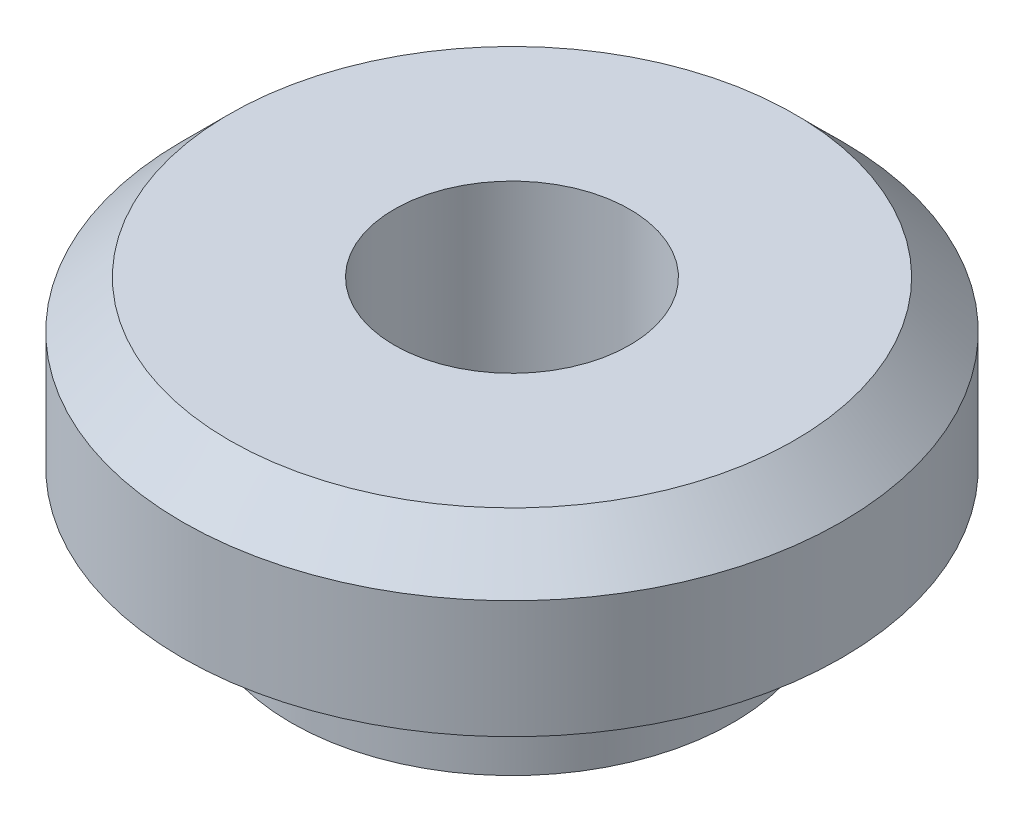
ISO-10303-21;
HEADER;
FILE_DESCRIPTION(('STEP AP214'),'2;1');
FILE_NAME('part.step','',(''),(''),'','','');
FILE_SCHEMA(('AUTOMOTIVE_DESIGN { 1 0 10303 214 1 1 1 1 }'));
ENDSEC;
DATA;
#1=APPLICATION_CONTEXT('core data for automotive mechanical design processes');
#2=APPLICATION_PROTOCOL_DEFINITION('international standard','automotive_design',2000,#1);
#3=PRODUCT_CONTEXT('',#1,'mechanical');
#4=PRODUCT('Part','Part','',(#3));
#5=PRODUCT_RELATED_PRODUCT_CATEGORY('part','',(#4));
#6=PRODUCT_DEFINITION_FORMATION('','',#4);
#7=PRODUCT_DEFINITION_CONTEXT('part definition',#1,'design');
#8=PRODUCT_DEFINITION('design','',#6,#7);
#9=PRODUCT_DEFINITION_SHAPE('','',#8);
#10=(LENGTH_UNIT() NAMED_UNIT(*) SI_UNIT(.MILLI.,.METRE.));
#11=(NAMED_UNIT(*) PLANE_ANGLE_UNIT() SI_UNIT($,.RADIAN.));
#12=(NAMED_UNIT(*) SI_UNIT($,.STERADIAN.) SOLID_ANGLE_UNIT());
#13=UNCERTAINTY_MEASURE_WITH_UNIT(LENGTH_MEASURE(1.E-05),#10,'distance_accuracy_value','');
#14=(GEOMETRIC_REPRESENTATION_CONTEXT(3) GLOBAL_UNCERTAINTY_ASSIGNED_CONTEXT((#13)) GLOBAL_UNIT_ASSIGNED_CONTEXT((#10,
#11,#12)) REPRESENTATION_CONTEXT('',''));
#15=CARTESIAN_POINT('',(0.,0.,0.));
#16=DIRECTION('',(0.,0.,1.));
#17=DIRECTION('',(1.,0.,0.));
#18=AXIS2_PLACEMENT_3D('',#15,#16,#17);
#19=CARTESIAN_POINT('',(0.,1.778,1.27));
#20=DIRECTION('',(0.,1.,0.));
#21=DIRECTION('',(0.,0.,1.));
#22=AXIS2_PLACEMENT_3D('',#19,#20,#21);
#23=PLANE('',#22);
#24=CARTESIAN_POINT('',(0.,1.778,0.));
#25=DIRECTION('',(0.,1.,0.));
#26=DIRECTION('',(0.,0.,1.));
#27=AXIS2_PLACEMENT_3D('',#24,#25,#26);
#28=CIRCLE('',#27,3.048);
#29=CARTESIAN_POINT('',(0.,1.778,3.048));
#30=VERTEX_POINT('',#29);
#31=EDGE_CURVE('E10',#30,#30,#28,.T.);
#32=ORIENTED_EDGE('',*,*,#31,.T.);
#33=EDGE_LOOP('',(#32));
#34=FACE_BOUND('',#33,.T.);
#35=CARTESIAN_POINT('',(0.,1.778,0.));
#36=DIRECTION('',(0.,1.,0.));
#37=DIRECTION('',(0.,0.,1.));
#38=AXIS2_PLACEMENT_3D('',#35,#36,#37);
#39=CIRCLE('',#38,1.27);
#40=CARTESIAN_POINT('',(0.,1.778,1.27));
#41=VERTEX_POINT('',#40);
#42=EDGE_CURVE('E59',#41,#41,#39,.T.);
#43=ORIENTED_EDGE('',*,*,#42,.F.);
#44=EDGE_LOOP('',(#43));
#45=FACE_BOUND('',#44,.T.);
#46=ADVANCED_FACE('F34',(#34,#45),#23,.T.);
#47=CARTESIAN_POINT('',(0.,1.778,0.));
#48=DIRECTION('',(0.,-1.,0.));
#49=DIRECTION('',(0.,0.,-1.));
#50=AXIS2_PLACEMENT_3D('',#47,#48,#49);
#51=CONICAL_SURFACE('',#50,3.048,0.785398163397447);
#52=CARTESIAN_POINT('',(0.,1.27,0.));
#53=DIRECTION('',(0.,1.,0.));
#54=DIRECTION('',(0.,0.,1.));
#55=AXIS2_PLACEMENT_3D('',#52,#53,#54);
#56=CIRCLE('',#55,3.556);
#57=CARTESIAN_POINT('',(0.,1.27,3.556));
#58=VERTEX_POINT('',#57);
#59=EDGE_CURVE('E40',#58,#58,#56,.T.);
#60=ORIENTED_EDGE('',*,*,#59,.T.);
#61=EDGE_LOOP('',(#60));
#62=FACE_BOUND('',#61,.T.);
#63=ORIENTED_EDGE('',*,*,#31,.F.);
#64=EDGE_LOOP('',(#63));
#65=FACE_BOUND('',#64,.T.);
#66=ADVANCED_FACE('F66',(#62,#65),#51,.T.);
#67=CARTESIAN_POINT('',(0.,40.,0.));
#68=DIRECTION('',(0.,1.,0.));
#69=DIRECTION('',(0.,0.,1.));
#70=AXIS2_PLACEMENT_3D('',#67,#68,#69);
#71=CYLINDRICAL_SURFACE('',#70,3.556);
#72=CARTESIAN_POINT('',(0.,0.,0.));
#73=DIRECTION('',(0.,1.,0.));
#74=DIRECTION('',(0.,0.,1.));
#75=AXIS2_PLACEMENT_3D('',#72,#73,#74);
#76=CIRCLE('',#75,3.556);
#77=CARTESIAN_POINT('',(0.,0.,3.556));
#78=VERTEX_POINT('',#77);
#79=EDGE_CURVE('E44',#78,#78,#76,.T.);
#80=ORIENTED_EDGE('',*,*,#79,.T.);
#81=EDGE_LOOP('',(#80));
#82=FACE_BOUND('',#81,.T.);
#83=ORIENTED_EDGE('',*,*,#59,.F.);
#84=EDGE_LOOP('',(#83));
#85=FACE_BOUND('',#84,.T.);
#86=ADVANCED_FACE('F70',(#82,#85),#71,.T.);
#87=CARTESIAN_POINT('',(0.,0.,3.556));
#88=DIRECTION('',(0.,-1.,0.));
#89=DIRECTION('',(0.,0.,-1.));
#90=AXIS2_PLACEMENT_3D('',#87,#88,#89);
#91=PLANE('',#90);
#92=CARTESIAN_POINT('',(0.,0.,0.));
#93=DIRECTION('',(0.,1.,0.));
#94=DIRECTION('',(0.,0.,1.));
#95=AXIS2_PLACEMENT_3D('',#92,#93,#94);
#96=CIRCLE('',#95,2.38125);
#97=CARTESIAN_POINT('',(0.,0.,2.38125));
#98=VERTEX_POINT('',#97);
#99=EDGE_CURVE('E48',#98,#98,#96,.T.);
#100=ORIENTED_EDGE('',*,*,#99,.T.);
#101=EDGE_LOOP('',(#100));
#102=FACE_BOUND('',#101,.T.);
#103=ORIENTED_EDGE('',*,*,#79,.F.);
#104=EDGE_LOOP('',(#103));
#105=FACE_BOUND('',#104,.T.);
#106=ADVANCED_FACE('F74',(#102,#105),#91,.T.);
#107=CARTESIAN_POINT('',(0.,40.,0.));
#108=DIRECTION('',(0.,1.,0.));
#109=DIRECTION('',(0.,0.,1.));
#110=AXIS2_PLACEMENT_3D('',#107,#108,#109);
#111=CYLINDRICAL_SURFACE('',#110,2.38125);
#112=CARTESIAN_POINT('',(0.,-1.1938,0.));
#113=DIRECTION('',(0.,1.,0.));
#114=DIRECTION('',(0.,0.,1.));
#115=AXIS2_PLACEMENT_3D('',#112,#113,#114);
#116=CIRCLE('',#115,2.38125);
#117=CARTESIAN_POINT('',(0.,-1.1938,2.38125));
#118=VERTEX_POINT('',#117);
#119=EDGE_CURVE('E53',#118,#118,#116,.T.);
#120=ORIENTED_EDGE('',*,*,#119,.T.);
#121=EDGE_LOOP('',(#120));
#122=FACE_BOUND('',#121,.T.);
#123=ORIENTED_EDGE('',*,*,#99,.F.);
#124=EDGE_LOOP('',(#123));
#125=FACE_BOUND('',#124,.T.);
#126=ADVANCED_FACE('F81',(#122,#125),#111,.T.);
#127=CARTESIAN_POINT('',(0.,-1.1938,2.38125));
#128=DIRECTION('',(0.,-1.,0.));
#129=DIRECTION('',(0.,0.,-1.));
#130=AXIS2_PLACEMENT_3D('',#127,#128,#129);
#131=PLANE('',#130);
#132=CARTESIAN_POINT('',(0.,-1.1938,0.));
#133=DIRECTION('',(0.,1.,0.));
#134=DIRECTION('',(0.,0.,1.));
#135=AXIS2_PLACEMENT_3D('',#132,#133,#134);
#136=CIRCLE('',#135,1.27);
#137=CARTESIAN_POINT('',(0.,-1.1938,1.27));
#138=VERTEX_POINT('',#137);
#139=EDGE_CURVE('E56',#138,#138,#136,.T.);
#140=ORIENTED_EDGE('',*,*,#139,.T.);
#141=EDGE_LOOP('',(#140));
#142=FACE_BOUND('',#141,.T.);
#143=ORIENTED_EDGE('',*,*,#119,.F.);
#144=EDGE_LOOP('',(#143));
#145=FACE_BOUND('',#144,.T.);
#146=ADVANCED_FACE('F85',(#142,#145),#131,.T.);
#147=CARTESIAN_POINT('',(0.,40.,0.));
#148=DIRECTION('',(0.,1.,0.));
#149=DIRECTION('',(0.,0.,1.));
#150=AXIS2_PLACEMENT_3D('',#147,#148,#149);
#151=CYLINDRICAL_SURFACE('',#150,1.27);
#152=ORIENTED_EDGE('',*,*,#139,.F.);
#153=EDGE_LOOP('',(#152));
#154=FACE_BOUND('',#153,.T.);
#155=ORIENTED_EDGE('',*,*,#42,.T.);
#156=EDGE_LOOP('',(#155));
#157=FACE_BOUND('',#156,.T.);
#158=ADVANCED_FACE('F63',(#154,#157),#151,.F.);
#159=CLOSED_SHELL('',(#46,#66,#86,#106,#126,#146,#158));
#160=MANIFOLD_SOLID_BREP('B2',#159);
#161=ADVANCED_BREP_SHAPE_REPRESENTATION('',(#18,#160),#14);
#162=SHAPE_DEFINITION_REPRESENTATION(#9,#161);
ENDSEC;
END-ISO-10303-21;
